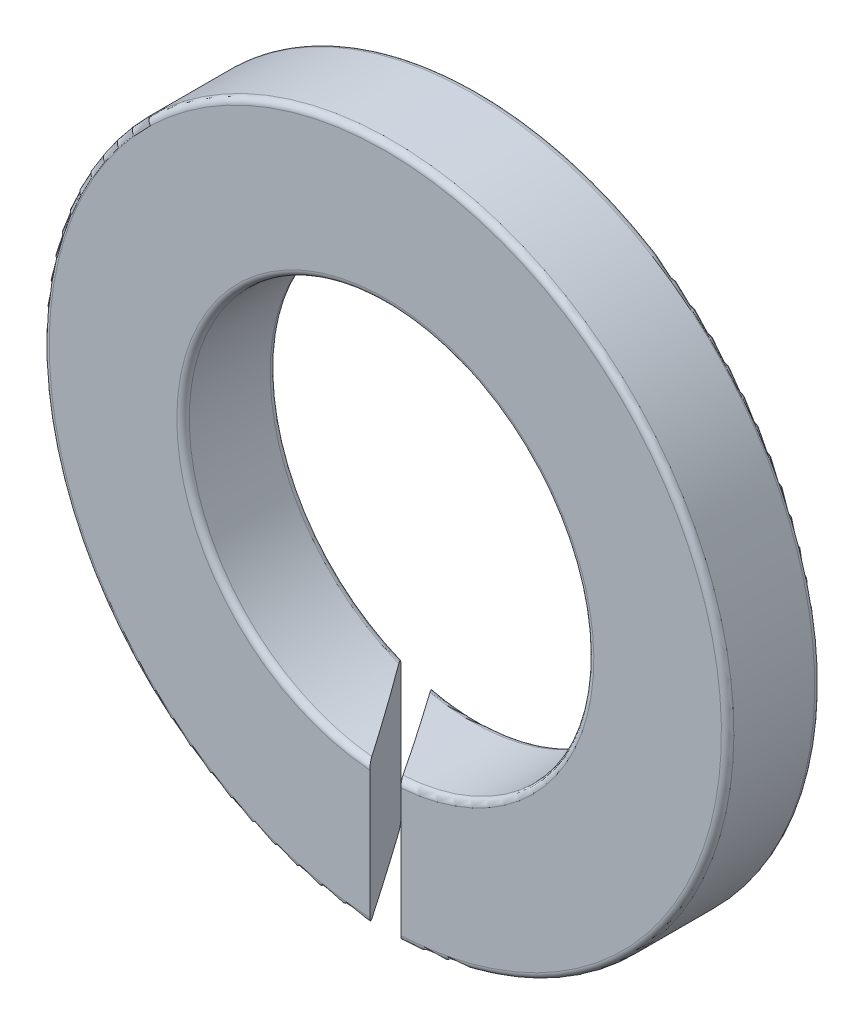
from build123d import *

# Parameters (mm, degrees)
ESQUISSE1_R             = 5.5
ESQUISSE1_R_2           = 3.25
BASE_EXTRUSION_DEPTH    = 1.5
ENL_V_MAT_EXTRU_1_DEPTH = 8.921489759
CONG_1_R                = 0.1


with BuildPart() as part:
    # Esquisse1 → Base-Extrusion (new body)
    with BuildSketch(Plane.XY):
        Circle(ESQUISSE1_R)
        Circle(ESQUISSE1_R_2, mode=Mode.SUBTRACT)
    extrude(amount=-BASE_EXTRUSION_DEPTH)

    # Esquisse2 → Enl_v. mat.-Extru.1 (cut, through all)
    with BuildSketch(Plane(origin=(0, 0, 0), x_dir=(1, 0, 0), z_dir=(0, 1, 0))):
        Polygon((-0.25, 0), (0.25, 0), (-0.75, 1.5), (-1.25, 1.5), align=None)
    extrude(amount=-ENL_V_MAT_EXTRU_1_DEPTH, mode=Mode.SUBTRACT)

    # Cong_1
    cong_1_edges = [part.edges().sort_by_distance(p)[0] for p in [
        (-2.207940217, 2.384848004, 0),
        (-1.802775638, 2.704163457, -1.5),
        (-3.418698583, 4.308421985, -1.5),
        (-3.799671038, 3.97649343, 0),
    ]]
    fillet(cong_1_edges, radius=CONG_1_R)


solid = part.part
